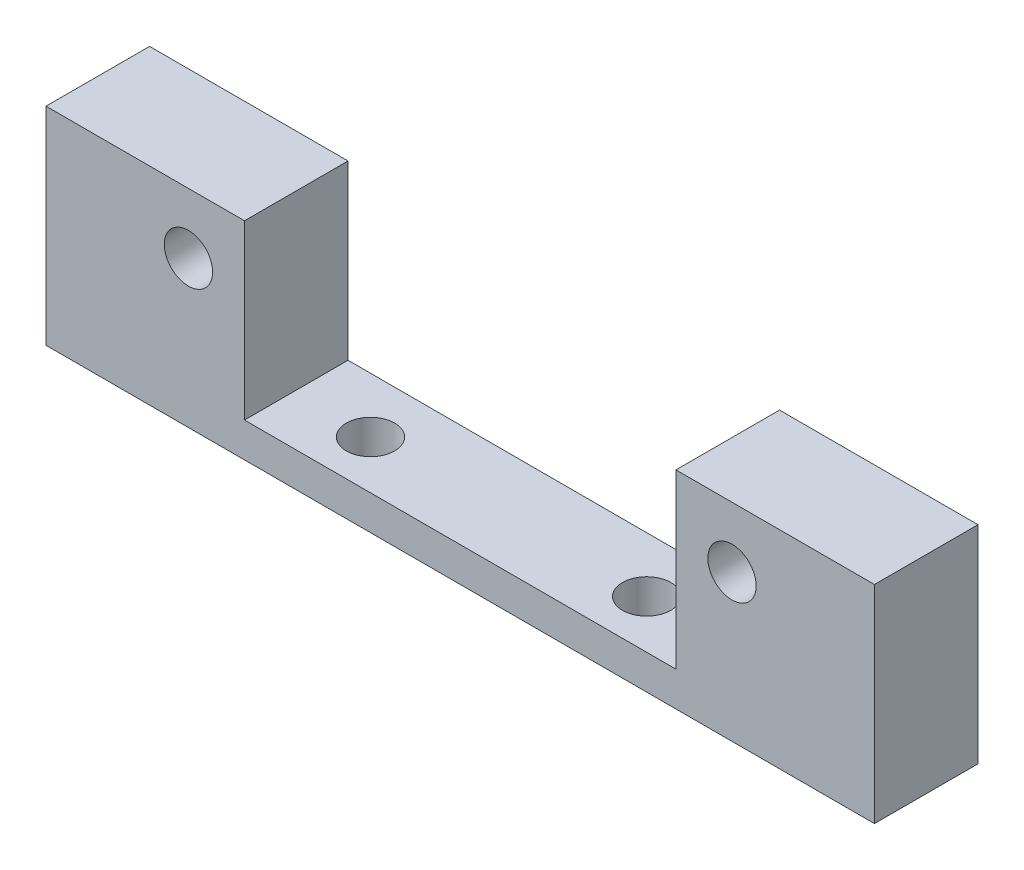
ISO-10303-21;
HEADER;
FILE_DESCRIPTION(('STEP AP214'),'2;1');
FILE_NAME('part.step','',(''),(''),'','','');
FILE_SCHEMA(('AUTOMOTIVE_DESIGN { 1 0 10303 214 1 1 1 1 }'));
ENDSEC;
DATA;
#1=APPLICATION_CONTEXT('core data for automotive mechanical design processes');
#2=APPLICATION_PROTOCOL_DEFINITION('international standard','automotive_design',2000,#1);
#3=PRODUCT_CONTEXT('',#1,'mechanical');
#4=PRODUCT('Part','Part','',(#3));
#5=PRODUCT_RELATED_PRODUCT_CATEGORY('part','',(#4));
#6=PRODUCT_DEFINITION_FORMATION('','',#4);
#7=PRODUCT_DEFINITION_CONTEXT('part definition',#1,'design');
#8=PRODUCT_DEFINITION('design','',#6,#7);
#9=PRODUCT_DEFINITION_SHAPE('','',#8);
#10=(LENGTH_UNIT() NAMED_UNIT(*) SI_UNIT(.MILLI.,.METRE.));
#11=(NAMED_UNIT(*) PLANE_ANGLE_UNIT() SI_UNIT($,.RADIAN.));
#12=(NAMED_UNIT(*) SI_UNIT($,.STERADIAN.) SOLID_ANGLE_UNIT());
#13=UNCERTAINTY_MEASURE_WITH_UNIT(LENGTH_MEASURE(1.E-05),#10,'distance_accuracy_value','');
#14=(GEOMETRIC_REPRESENTATION_CONTEXT(3) GLOBAL_UNCERTAINTY_ASSIGNED_CONTEXT((#13)) GLOBAL_UNIT_ASSIGNED_CONTEXT((#10,
#11,#12)) REPRESENTATION_CONTEXT('',''));
#15=CARTESIAN_POINT('',(0.,0.,0.));
#16=DIRECTION('',(0.,0.,1.));
#17=DIRECTION('',(1.,0.,0.));
#18=AXIS2_PLACEMENT_3D('',#15,#16,#17);
#19=CARTESIAN_POINT('',(0.,0.,0.));
#20=DIRECTION('',(0.,-1.,0.));
#21=DIRECTION('',(0.,0.,-1.));
#22=AXIS2_PLACEMENT_3D('',#19,#20,#21);
#23=PLANE('',#22);
#24=DIRECTION('',(1.,0.,0.));
#25=VECTOR('',#24,1.);
#26=CARTESIAN_POINT('',(-76.2,0.,6.35));
#27=LINE('',#26,#25);
#28=CARTESIAN_POINT('',(-76.2,0.,6.35));
#29=VERTEX_POINT('',#28);
#30=CARTESIAN_POINT('',(-39.6875,0.,6.35));
#31=VERTEX_POINT('',#30);
#32=EDGE_CURVE('E178',#29,#31,#27,.T.);
#33=ORIENTED_EDGE('',*,*,#32,.T.);
#34=DIRECTION('',(0.,0.,1.));
#35=VECTOR('',#34,1.);
#36=CARTESIAN_POINT('',(-39.6875,0.,-12.7));
#37=LINE('',#36,#35);
#38=CARTESIAN_POINT('',(-39.6875,0.,-12.7));
#39=VERTEX_POINT('',#38);
#40=EDGE_CURVE('E138',#39,#31,#37,.T.);
#41=ORIENTED_EDGE('',*,*,#40,.F.);
#42=DIRECTION('',(-1.,0.,0.));
#43=VECTOR('',#42,1.);
#44=CARTESIAN_POINT('',(-76.2,0.,-12.7));
#45=LINE('',#44,#43);
#46=CARTESIAN_POINT('',(-76.2,0.,-12.7));
#47=VERTEX_POINT('',#46);
#48=EDGE_CURVE('E79',#39,#47,#45,.T.);
#49=ORIENTED_EDGE('',*,*,#48,.T.);
#50=DIRECTION('',(0.,0.,1.));
#51=VECTOR('',#50,1.);
#52=CARTESIAN_POINT('',(-76.2,0.,6.35));
#53=LINE('',#52,#51);
#54=EDGE_CURVE('E164',#47,#29,#53,.T.);
#55=ORIENTED_EDGE('',*,*,#54,.T.);
#56=EDGE_LOOP('',(#33,#41,#49,#55));
#57=FACE_BOUND('',#56,.T.);
#58=ADVANCED_FACE('F32',(#57),#23,.F.);
#59=CARTESIAN_POINT('',(-76.2,-38.1,6.35));
#60=DIRECTION('',(-1.,0.,0.));
#61=DIRECTION('',(0.,0.,1.));
#62=AXIS2_PLACEMENT_3D('',#59,#60,#61);
#63=PLANE('',#62);
#64=ORIENTED_EDGE('',*,*,#54,.F.);
#65=DIRECTION('',(0.,1.,0.));
#66=VECTOR('',#65,1.);
#67=CARTESIAN_POINT('',(-76.2,-38.1,-12.7));
#68=LINE('',#67,#66);
#69=CARTESIAN_POINT('',(-76.2,-38.1,-12.7));
#70=VERTEX_POINT('',#69);
#71=EDGE_CURVE('E11',#70,#47,#68,.T.);
#72=ORIENTED_EDGE('',*,*,#71,.F.);
#73=DIRECTION('',(0.,0.,1.));
#74=VECTOR('',#73,1.);
#75=CARTESIAN_POINT('',(-76.2,-38.1,6.35));
#76=LINE('',#75,#74);
#77=CARTESIAN_POINT('',(-76.2,-38.1,6.35));
#78=VERTEX_POINT('',#77);
#79=EDGE_CURVE('E165',#70,#78,#76,.T.);
#80=ORIENTED_EDGE('',*,*,#79,.T.);
#81=DIRECTION('',(0.,1.,0.));
#82=VECTOR('',#81,1.);
#83=CARTESIAN_POINT('',(-76.2,-38.1,6.35));
#84=LINE('',#83,#82);
#85=EDGE_CURVE('E85',#78,#29,#84,.T.);
#86=ORIENTED_EDGE('',*,*,#85,.T.);
#87=EDGE_LOOP('',(#64,#72,#80,#86));
#88=FACE_BOUND('',#87,.T.);
#89=ADVANCED_FACE('F34',(#88),#63,.T.);
#90=CARTESIAN_POINT('',(-76.2,-38.1,-12.7));
#91=DIRECTION('',(0.,0.,-1.));
#92=DIRECTION('',(-1.,0.,0.));
#93=AXIS2_PLACEMENT_3D('',#90,#91,#92);
#94=PLANE('',#93);
#95=DIRECTION('',(0.,-1.,0.));
#96=VECTOR('',#95,1.);
#97=CARTESIAN_POINT('',(-39.6875,0.,-12.7));
#98=LINE('',#97,#96);
#99=CARTESIAN_POINT('',(-39.6875,-31.75,-12.7));
#100=VERTEX_POINT('',#99);
#101=EDGE_CURVE('E112',#39,#100,#98,.T.);
#102=ORIENTED_EDGE('',*,*,#101,.T.);
#103=DIRECTION('',(1.,0.,0.));
#104=VECTOR('',#103,1.);
#105=CARTESIAN_POINT('',(-39.6875,-31.75,-12.7));
#106=LINE('',#105,#104);
#107=CARTESIAN_POINT('',(39.6875,-31.75,-12.7));
#108=VERTEX_POINT('',#107);
#109=EDGE_CURVE('E122',#100,#108,#106,.T.);
#110=ORIENTED_EDGE('',*,*,#109,.T.);
#111=DIRECTION('',(0.,1.,0.));
#112=VECTOR('',#111,1.);
#113=CARTESIAN_POINT('',(39.6875,0.,-12.7));
#114=LINE('',#113,#112);
#115=CARTESIAN_POINT('',(39.6875,0.,-12.7));
#116=VERTEX_POINT('',#115);
#117=EDGE_CURVE('E119',#108,#116,#114,.T.);
#118=ORIENTED_EDGE('',*,*,#117,.T.);
#119=CARTESIAN_POINT('',(76.2,0.,-12.7));
#120=VERTEX_POINT('',#119);
#121=EDGE_CURVE('E168',#120,#116,#45,.T.);
#122=ORIENTED_EDGE('',*,*,#121,.F.);
#123=DIRECTION('',(0.,1.,0.));
#124=VECTOR('',#123,1.);
#125=CARTESIAN_POINT('',(76.2,-38.1,-12.7));
#126=LINE('',#125,#124);
#127=CARTESIAN_POINT('',(76.2,-38.1,-12.7));
#128=VERTEX_POINT('',#127);
#129=EDGE_CURVE('E41',#128,#120,#126,.T.);
#130=ORIENTED_EDGE('',*,*,#129,.F.);
#131=DIRECTION('',(-1.,0.,0.));
#132=VECTOR('',#131,1.);
#133=CARTESIAN_POINT('',(-76.2,-38.1,-12.7));
#134=LINE('',#133,#132);
#135=EDGE_CURVE('E173',#128,#70,#134,.T.);
#136=ORIENTED_EDGE('',*,*,#135,.T.);
#137=ORIENTED_EDGE('',*,*,#71,.T.);
#138=ORIENTED_EDGE('',*,*,#48,.F.);
#139=EDGE_LOOP('',(#102,#110,#118,#122,#130,#136,#137,#138));
#140=FACE_BOUND('',#139,.T.);
#141=CARTESIAN_POINT('',(49.9999,-11.1252,-12.7));
#142=DIRECTION('',(0.,0.,-1.));
#143=DIRECTION('',(-1.,0.,0.));
#144=AXIS2_PLACEMENT_3D('',#141,#142,#143);
#145=CIRCLE('',#144,4.445);
#146=CARTESIAN_POINT('',(54.4449,-11.1252,-12.7));
#147=VERTEX_POINT('',#146);
#148=EDGE_CURVE('E149',#147,#147,#145,.T.);
#149=ORIENTED_EDGE('',*,*,#148,.F.);
#150=EDGE_LOOP('',(#149));
#151=FACE_BOUND('',#150,.T.);
#152=CARTESIAN_POINT('',(-49.9999,-11.1252,-12.7));
#153=DIRECTION('',(0.,0.,-1.));
#154=DIRECTION('',(-1.,0.,0.));
#155=AXIS2_PLACEMENT_3D('',#152,#153,#154);
#156=CIRCLE('',#155,4.445);
#157=CARTESIAN_POINT('',(-45.5549,-11.1252,-12.7));
#158=VERTEX_POINT('',#157);
#159=EDGE_CURVE('E155',#158,#158,#156,.T.);
#160=ORIENTED_EDGE('',*,*,#159,.F.);
#161=EDGE_LOOP('',(#160));
#162=FACE_BOUND('',#161,.T.);
#163=ADVANCED_FACE('F129',(#140,#151,#162),#94,.T.);
#164=CARTESIAN_POINT('',(76.2,-38.1,6.35));
#165=DIRECTION('',(1.,0.,0.));
#166=DIRECTION('',(0.,0.,-1.));
#167=AXIS2_PLACEMENT_3D('',#164,#165,#166);
#168=PLANE('',#167);
#169=DIRECTION('',(0.,0.,-1.));
#170=VECTOR('',#169,1.);
#171=CARTESIAN_POINT('',(76.2,0.,6.35));
#172=LINE('',#171,#170);
#173=CARTESIAN_POINT('',(76.2,0.,6.35));
#174=VERTEX_POINT('',#173);
#175=EDGE_CURVE('E181',#174,#120,#172,.T.);
#176=ORIENTED_EDGE('',*,*,#175,.F.);
#177=DIRECTION('',(0.,1.,0.));
#178=VECTOR('',#177,1.);
#179=CARTESIAN_POINT('',(76.2,-38.1,6.35));
#180=LINE('',#179,#178);
#181=CARTESIAN_POINT('',(76.2,-38.1,6.35));
#182=VERTEX_POINT('',#181);
#183=EDGE_CURVE('E187',#182,#174,#180,.T.);
#184=ORIENTED_EDGE('',*,*,#183,.F.);
#185=DIRECTION('',(0.,0.,-1.));
#186=VECTOR('',#185,1.);
#187=CARTESIAN_POINT('',(76.2,-38.1,6.35));
#188=LINE('',#187,#186);
#189=EDGE_CURVE('E170',#182,#128,#188,.T.);
#190=ORIENTED_EDGE('',*,*,#189,.T.);
#191=ORIENTED_EDGE('',*,*,#129,.T.);
#192=EDGE_LOOP('',(#176,#184,#190,#191));
#193=FACE_BOUND('',#192,.T.);
#194=ADVANCED_FACE('F217',(#193),#168,.T.);
#195=CARTESIAN_POINT('',(-76.2,-38.1,6.35));
#196=DIRECTION('',(0.,0.,1.));
#197=DIRECTION('',(1.,0.,0.));
#198=AXIS2_PLACEMENT_3D('',#195,#196,#197);
#199=PLANE('',#198);
#200=DIRECTION('',(0.,-1.,0.));
#201=VECTOR('',#200,1.);
#202=CARTESIAN_POINT('',(-39.6875,0.,6.35));
#203=LINE('',#202,#201);
#204=CARTESIAN_POINT('',(-39.6875,-31.75,6.35));
#205=VERTEX_POINT('',#204);
#206=EDGE_CURVE('E114',#31,#205,#203,.T.);
#207=ORIENTED_EDGE('',*,*,#206,.F.);
#208=ORIENTED_EDGE('',*,*,#32,.F.);
#209=ORIENTED_EDGE('',*,*,#85,.F.);
#210=DIRECTION('',(1.,0.,0.));
#211=VECTOR('',#210,1.);
#212=CARTESIAN_POINT('',(-76.2,-38.1,6.35));
#213=LINE('',#212,#211);
#214=EDGE_CURVE('E167',#78,#182,#213,.T.);
#215=ORIENTED_EDGE('',*,*,#214,.T.);
#216=ORIENTED_EDGE('',*,*,#183,.T.);
#217=CARTESIAN_POINT('',(39.6875,0.,6.35));
#218=VERTEX_POINT('',#217);
#219=EDGE_CURVE('E177',#218,#174,#27,.T.);
#220=ORIENTED_EDGE('',*,*,#219,.F.);
#221=DIRECTION('',(0.,1.,0.));
#222=VECTOR('',#221,1.);
#223=CARTESIAN_POINT('',(39.6875,0.,6.35));
#224=LINE('',#223,#222);
#225=CARTESIAN_POINT('',(39.6875,-31.75,6.35));
#226=VERTEX_POINT('',#225);
#227=EDGE_CURVE('E49',#226,#218,#224,.T.);
#228=ORIENTED_EDGE('',*,*,#227,.F.);
#229=DIRECTION('',(1.,0.,0.));
#230=VECTOR('',#229,1.);
#231=CARTESIAN_POINT('',(-39.6875,-31.75,6.35));
#232=LINE('',#231,#230);
#233=EDGE_CURVE('E132',#205,#226,#232,.T.);
#234=ORIENTED_EDGE('',*,*,#233,.F.);
#235=EDGE_LOOP('',(#207,#208,#209,#215,#216,#220,#228,#234));
#236=FACE_BOUND('',#235,.T.);
#237=CARTESIAN_POINT('',(49.9999,-11.1252,6.35));
#238=DIRECTION('',(0.,0.,1.));
#239=DIRECTION('',(1.,0.,0.));
#240=AXIS2_PLACEMENT_3D('',#237,#238,#239);
#241=CIRCLE('',#240,4.445);
#242=CARTESIAN_POINT('',(54.4449,-11.1252,6.35));
#243=VERTEX_POINT('',#242);
#244=EDGE_CURVE('E146',#243,#243,#241,.T.);
#245=ORIENTED_EDGE('',*,*,#244,.F.);
#246=EDGE_LOOP('',(#245));
#247=FACE_BOUND('',#246,.T.);
#248=CARTESIAN_POINT('',(-49.9999,-11.1252,6.35));
#249=DIRECTION('',(0.,0.,1.));
#250=DIRECTION('',(1.,0.,0.));
#251=AXIS2_PLACEMENT_3D('',#248,#249,#250);
#252=CIRCLE('',#251,4.445);
#253=CARTESIAN_POINT('',(-45.5549,-11.1252,6.35));
#254=VERTEX_POINT('',#253);
#255=EDGE_CURVE('E152',#254,#254,#252,.T.);
#256=ORIENTED_EDGE('',*,*,#255,.F.);
#257=EDGE_LOOP('',(#256));
#258=FACE_BOUND('',#257,.T.);
#259=ADVANCED_FACE('F189',(#236,#247,#258),#199,.T.);
#260=CARTESIAN_POINT('',(0.,-38.1,0.));
#261=DIRECTION('',(0.,-1.,0.));
#262=DIRECTION('',(0.,0.,-1.));
#263=AXIS2_PLACEMENT_3D('',#260,#261,#262);
#264=PLANE('',#263);
#265=CARTESIAN_POINT('',(25.4,-38.1,-2.54));
#266=DIRECTION('',(0.,1.,0.));
#267=DIRECTION('',(0.,0.,1.));
#268=AXIS2_PLACEMENT_3D('',#265,#266,#267);
#269=CIRCLE('',#268,4.445);
#270=CARTESIAN_POINT('',(25.4,-38.1,1.905));
#271=VERTEX_POINT('',#270);
#272=EDGE_CURVE('E158',#271,#271,#269,.T.);
#273=ORIENTED_EDGE('',*,*,#272,.T.);
#274=EDGE_LOOP('',(#273));
#275=FACE_BOUND('',#274,.T.);
#276=CARTESIAN_POINT('',(-25.4,-38.1,-2.54));
#277=DIRECTION('',(0.,1.,0.));
#278=DIRECTION('',(0.,0.,1.));
#279=AXIS2_PLACEMENT_3D('',#276,#277,#278);
#280=CIRCLE('',#279,4.445);
#281=CARTESIAN_POINT('',(-25.4,-38.1,1.905));
#282=VERTEX_POINT('',#281);
#283=EDGE_CURVE('E161',#282,#282,#280,.T.);
#284=ORIENTED_EDGE('',*,*,#283,.T.);
#285=EDGE_LOOP('',(#284));
#286=FACE_BOUND('',#285,.T.);
#287=ORIENTED_EDGE('',*,*,#79,.F.);
#288=ORIENTED_EDGE('',*,*,#135,.F.);
#289=ORIENTED_EDGE('',*,*,#189,.F.);
#290=ORIENTED_EDGE('',*,*,#214,.F.);
#291=EDGE_LOOP('',(#287,#288,#289,#290));
#292=FACE_BOUND('',#291,.T.);
#293=ADVANCED_FACE('F201',(#275,#286,#292),#264,.T.);
#294=ORIENTED_EDGE('',*,*,#121,.T.);
#295=DIRECTION('',(0.,0.,1.));
#296=VECTOR('',#295,1.);
#297=CARTESIAN_POINT('',(39.6875,0.,-12.7));
#298=LINE('',#297,#296);
#299=EDGE_CURVE('E140',#116,#218,#298,.T.);
#300=ORIENTED_EDGE('',*,*,#299,.T.);
#301=ORIENTED_EDGE('',*,*,#219,.T.);
#302=ORIENTED_EDGE('',*,*,#175,.T.);
#303=EDGE_LOOP('',(#294,#300,#301,#302));
#304=FACE_BOUND('',#303,.T.);
#305=ADVANCED_FACE('F193',(#304),#23,.F.);
#306=CARTESIAN_POINT('',(-25.4,-38.1,-2.54));
#307=DIRECTION('',(0.,1.,0.));
#308=DIRECTION('',(0.,0.,1.));
#309=AXIS2_PLACEMENT_3D('',#306,#307,#308);
#310=CYLINDRICAL_SURFACE('',#309,4.445);
#311=CARTESIAN_POINT('',(-25.4,-31.75,-2.54));
#312=DIRECTION('',(0.,-1.,0.));
#313=DIRECTION('',(0.,0.,-1.));
#314=AXIS2_PLACEMENT_3D('',#311,#312,#313);
#315=CIRCLE('',#314,4.445);
#316=CARTESIAN_POINT('',(-25.4,-31.75,1.905));
#317=VERTEX_POINT('',#316);
#318=EDGE_CURVE('E143',#317,#317,#315,.F.);
#319=CARTESIAN_POINT('',(-25.4,-31.75,1.905));
#320=CARTESIAN_POINT('',(-25.4,-31.8161458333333,1.905));
#321=CARTESIAN_POINT('',(-25.4,-31.8822916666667,1.905));
#322=CARTESIAN_POINT('',(-25.4,-32.0145833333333,1.905));
#323=CARTESIAN_POINT('',(-25.4,-32.0807291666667,1.905));
#324=CARTESIAN_POINT('',(-25.4,-32.2130208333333,1.905));
#325=CARTESIAN_POINT('',(-25.4,-32.2791666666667,1.905));
#326=CARTESIAN_POINT('',(-25.4,-32.4114583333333,1.905));
#327=CARTESIAN_POINT('',(-25.4,-32.4776041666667,1.905));
#328=CARTESIAN_POINT('',(-25.4,-32.6098958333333,1.905));
#329=CARTESIAN_POINT('',(-25.4,-32.6760416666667,1.905));
#330=CARTESIAN_POINT('',(-25.4,-32.8083333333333,1.905));
#331=CARTESIAN_POINT('',(-25.4,-32.8744791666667,1.905));
#332=CARTESIAN_POINT('',(-25.4,-33.0067708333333,1.905));
#333=CARTESIAN_POINT('',(-25.4,-33.0729166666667,1.905));
#334=CARTESIAN_POINT('',(-25.4,-33.2052083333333,1.905));
#335=CARTESIAN_POINT('',(-25.4,-33.2713541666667,1.905));
#336=CARTESIAN_POINT('',(-25.4,-33.4036458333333,1.905));
#337=CARTESIAN_POINT('',(-25.4,-33.4697916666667,1.905));
#338=CARTESIAN_POINT('',(-25.4,-33.6020833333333,1.905));
#339=CARTESIAN_POINT('',(-25.4,-33.6682291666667,1.905));
#340=CARTESIAN_POINT('',(-25.4,-33.8005208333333,1.905));
#341=CARTESIAN_POINT('',(-25.4,-33.8666666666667,1.905));
#342=CARTESIAN_POINT('',(-25.4,-33.9989583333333,1.905));
#343=CARTESIAN_POINT('',(-25.4,-34.0651041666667,1.905));
#344=CARTESIAN_POINT('',(-25.4,-34.1973958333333,1.905));
#345=CARTESIAN_POINT('',(-25.4,-34.2635416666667,1.905));
#346=CARTESIAN_POINT('',(-25.4,-34.3958333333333,1.905));
#347=CARTESIAN_POINT('',(-25.4,-34.4619791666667,1.905));
#348=CARTESIAN_POINT('',(-25.4,-34.5942708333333,1.905));
#349=CARTESIAN_POINT('',(-25.4,-34.6604166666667,1.905));
#350=CARTESIAN_POINT('',(-25.4,-34.7927083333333,1.905));
#351=CARTESIAN_POINT('',(-25.4,-34.8588541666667,1.905));
#352=CARTESIAN_POINT('',(-25.4,-34.9911458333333,1.905));
#353=CARTESIAN_POINT('',(-25.4,-35.0572916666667,1.905));
#354=CARTESIAN_POINT('',(-25.4,-35.1895833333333,1.905));
#355=CARTESIAN_POINT('',(-25.4,-35.2557291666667,1.905));
#356=CARTESIAN_POINT('',(-25.4,-35.3880208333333,1.905));
#357=CARTESIAN_POINT('',(-25.4,-35.4541666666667,1.905));
#358=CARTESIAN_POINT('',(-25.4,-35.5864583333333,1.905));
#359=CARTESIAN_POINT('',(-25.4,-35.6526041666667,1.905));
#360=CARTESIAN_POINT('',(-25.4,-35.7848958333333,1.905));
#361=CARTESIAN_POINT('',(-25.4,-35.8510416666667,1.905));
#362=CARTESIAN_POINT('',(-25.4,-35.9833333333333,1.905));
#363=CARTESIAN_POINT('',(-25.4,-36.0494791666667,1.905));
#364=CARTESIAN_POINT('',(-25.4,-36.1817708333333,1.905));
#365=CARTESIAN_POINT('',(-25.4,-36.2479166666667,1.905));
#366=CARTESIAN_POINT('',(-25.4,-36.3802083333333,1.905));
#367=CARTESIAN_POINT('',(-25.4,-36.4463541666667,1.905));
#368=CARTESIAN_POINT('',(-25.4,-36.5786458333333,1.905));
#369=CARTESIAN_POINT('',(-25.4,-36.6447916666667,1.905));
#370=CARTESIAN_POINT('',(-25.4,-36.7770833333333,1.905));
#371=CARTESIAN_POINT('',(-25.4,-36.8432291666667,1.905));
#372=CARTESIAN_POINT('',(-25.4,-36.9755208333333,1.905));
#373=CARTESIAN_POINT('',(-25.4,-37.0416666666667,1.905));
#374=CARTESIAN_POINT('',(-25.4,-37.1739583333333,1.905));
#375=CARTESIAN_POINT('',(-25.4,-37.2401041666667,1.905));
#376=CARTESIAN_POINT('',(-25.4,-37.3723958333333,1.905));
#377=CARTESIAN_POINT('',(-25.4,-37.4385416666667,1.905));
#378=CARTESIAN_POINT('',(-25.4,-37.5708333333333,1.905));
#379=CARTESIAN_POINT('',(-25.4,-37.6369791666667,1.905));
#380=CARTESIAN_POINT('',(-25.4,-37.7692708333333,1.905));
#381=CARTESIAN_POINT('',(-25.4,-37.8354166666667,1.905));
#382=CARTESIAN_POINT('',(-25.4,-37.9677083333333,1.905));
#383=CARTESIAN_POINT('',(-25.4,-38.0338541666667,1.905));
#384=CARTESIAN_POINT('',(-25.4,-38.1,1.905));
#385=B_SPLINE_CURVE_WITH_KNOTS('',3,(#319,#320,#321,#322,#323,#324,#325,#326,#327,#328,#329,
#330,#331,#332,#333,#334,#335,#336,#337,#338,#339,#340,#341,#342,#343,#344,#345,#346,#347,#348,
#349,#350,#351,#352,#353,#354,#355,#356,#357,#358,#359,#360,#361,#362,#363,#364,#365,#366,#367,
#368,#369,#370,#371,#372,#373,#374,#375,#376,#377,#378,#379,#380,#381,#382,#383,#384),
.UNSPECIFIED.,.F.,.F.,(4,2,2,2,2,2,2,2,2,2,2,2,2,2,2,2,2,2,2,2,2,2,2,2,2,2,2,2,2,2,2,2,4),(0.,
0.198437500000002,0.396875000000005,0.595312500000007,0.793750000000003,0.992187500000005,
1.19062500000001,1.3890625,1.58750000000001,1.78593750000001,1.984375,2.18281250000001,
2.38125000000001,2.5796875,2.77812500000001,2.97656250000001,3.175,3.37343750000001,
3.57187500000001,3.7703125,3.96875000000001,4.16718750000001,4.36562500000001,4.56406250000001,
4.76250000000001,4.96093750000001,5.15937500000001,5.35781250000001,5.55625000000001,
5.75468750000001,5.95312500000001,6.15156250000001,6.35000000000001),.UNSPECIFIED.);
#386=EDGE_CURVE('BSEAM200',#317,#282,#385,.T.);
#387=ORIENTED_EDGE('',*,*,#318,.T.);
#388=ORIENTED_EDGE('',*,*,#283,.F.);
#389=ORIENTED_EDGE('',*,*,#386,.T.);
#390=ORIENTED_EDGE('',*,*,#386,.F.);
#391=EDGE_LOOP('',(#387,#389,#388,#390));
#392=FACE_BOUND('',#391,.T.);
#393=ADVANCED_FACE('F200',(#392),#310,.F.);
#394=CARTESIAN_POINT('',(25.4,-38.1,-2.54));
#395=DIRECTION('',(0.,1.,0.));
#396=DIRECTION('',(0.,0.,1.));
#397=AXIS2_PLACEMENT_3D('',#394,#395,#396);
#398=CYLINDRICAL_SURFACE('',#397,4.445);
#399=CARTESIAN_POINT('',(25.4,-31.75,-2.54));
#400=DIRECTION('',(0.,-1.,0.));
#401=DIRECTION('',(0.,0.,-1.));
#402=AXIS2_PLACEMENT_3D('',#399,#400,#401);
#403=CIRCLE('',#402,4.445);
#404=CARTESIAN_POINT('',(25.4,-31.75,1.905));
#405=VERTEX_POINT('',#404);
#406=EDGE_CURVE('E36',#405,#405,#403,.F.);
#407=CARTESIAN_POINT('',(25.4,-31.75,1.905));
#408=CARTESIAN_POINT('',(25.4,-31.8161458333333,1.905));
#409=CARTESIAN_POINT('',(25.4,-31.8822916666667,1.905));
#410=CARTESIAN_POINT('',(25.4,-32.0145833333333,1.905));
#411=CARTESIAN_POINT('',(25.4,-32.0807291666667,1.905));
#412=CARTESIAN_POINT('',(25.4,-32.2130208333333,1.905));
#413=CARTESIAN_POINT('',(25.4,-32.2791666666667,1.905));
#414=CARTESIAN_POINT('',(25.4,-32.4114583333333,1.905));
#415=CARTESIAN_POINT('',(25.4,-32.4776041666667,1.905));
#416=CARTESIAN_POINT('',(25.4,-32.6098958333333,1.905));
#417=CARTESIAN_POINT('',(25.4,-32.6760416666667,1.905));
#418=CARTESIAN_POINT('',(25.4,-32.8083333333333,1.905));
#419=CARTESIAN_POINT('',(25.4,-32.8744791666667,1.905));
#420=CARTESIAN_POINT('',(25.4,-33.0067708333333,1.905));
#421=CARTESIAN_POINT('',(25.4,-33.0729166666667,1.905));
#422=CARTESIAN_POINT('',(25.4,-33.2052083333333,1.905));
#423=CARTESIAN_POINT('',(25.4,-33.2713541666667,1.905));
#424=CARTESIAN_POINT('',(25.4,-33.4036458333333,1.905));
#425=CARTESIAN_POINT('',(25.4,-33.4697916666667,1.905));
#426=CARTESIAN_POINT('',(25.4,-33.6020833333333,1.905));
#427=CARTESIAN_POINT('',(25.4,-33.6682291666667,1.905));
#428=CARTESIAN_POINT('',(25.4,-33.8005208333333,1.905));
#429=CARTESIAN_POINT('',(25.4,-33.8666666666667,1.905));
#430=CARTESIAN_POINT('',(25.4,-33.9989583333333,1.905));
#431=CARTESIAN_POINT('',(25.4,-34.0651041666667,1.905));
#432=CARTESIAN_POINT('',(25.4,-34.1973958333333,1.905));
#433=CARTESIAN_POINT('',(25.4,-34.2635416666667,1.905));
#434=CARTESIAN_POINT('',(25.4,-34.3958333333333,1.905));
#435=CARTESIAN_POINT('',(25.4,-34.4619791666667,1.905));
#436=CARTESIAN_POINT('',(25.4,-34.5942708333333,1.905));
#437=CARTESIAN_POINT('',(25.4,-34.6604166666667,1.905));
#438=CARTESIAN_POINT('',(25.4,-34.7927083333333,1.905));
#439=CARTESIAN_POINT('',(25.4,-34.8588541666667,1.905));
#440=CARTESIAN_POINT('',(25.4,-34.9911458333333,1.905));
#441=CARTESIAN_POINT('',(25.4,-35.0572916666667,1.905));
#442=CARTESIAN_POINT('',(25.4,-35.1895833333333,1.905));
#443=CARTESIAN_POINT('',(25.4,-35.2557291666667,1.905));
#444=CARTESIAN_POINT('',(25.4,-35.3880208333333,1.905));
#445=CARTESIAN_POINT('',(25.4,-35.4541666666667,1.905));
#446=CARTESIAN_POINT('',(25.4,-35.5864583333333,1.905));
#447=CARTESIAN_POINT('',(25.4,-35.6526041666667,1.905));
#448=CARTESIAN_POINT('',(25.4,-35.7848958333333,1.905));
#449=CARTESIAN_POINT('',(25.4,-35.8510416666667,1.905));
#450=CARTESIAN_POINT('',(25.4,-35.9833333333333,1.905));
#451=CARTESIAN_POINT('',(25.4,-36.0494791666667,1.905));
#452=CARTESIAN_POINT('',(25.4,-36.1817708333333,1.905));
#453=CARTESIAN_POINT('',(25.4,-36.2479166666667,1.905));
#454=CARTESIAN_POINT('',(25.4,-36.3802083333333,1.905));
#455=CARTESIAN_POINT('',(25.4,-36.4463541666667,1.905));
#456=CARTESIAN_POINT('',(25.4,-36.5786458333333,1.905));
#457=CARTESIAN_POINT('',(25.4,-36.6447916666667,1.905));
#458=CARTESIAN_POINT('',(25.4,-36.7770833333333,1.905));
#459=CARTESIAN_POINT('',(25.4,-36.8432291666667,1.905));
#460=CARTESIAN_POINT('',(25.4,-36.9755208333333,1.905));
#461=CARTESIAN_POINT('',(25.4,-37.0416666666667,1.905));
#462=CARTESIAN_POINT('',(25.4,-37.1739583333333,1.905));
#463=CARTESIAN_POINT('',(25.4,-37.2401041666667,1.905));
#464=CARTESIAN_POINT('',(25.4,-37.3723958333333,1.905));
#465=CARTESIAN_POINT('',(25.4,-37.4385416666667,1.905));
#466=CARTESIAN_POINT('',(25.4,-37.5708333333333,1.905));
#467=CARTESIAN_POINT('',(25.4,-37.6369791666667,1.905));
#468=CARTESIAN_POINT('',(25.4,-37.7692708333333,1.905));
#469=CARTESIAN_POINT('',(25.4,-37.8354166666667,1.905));
#470=CARTESIAN_POINT('',(25.4,-37.9677083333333,1.905));
#471=CARTESIAN_POINT('',(25.4,-38.0338541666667,1.905));
#472=CARTESIAN_POINT('',(25.4,-38.1,1.905));
#473=B_SPLINE_CURVE_WITH_KNOTS('',3,(#407,#408,#409,#410,#411,#412,#413,#414,#415,#416,#417,
#418,#419,#420,#421,#422,#423,#424,#425,#426,#427,#428,#429,#430,#431,#432,#433,#434,#435,#436,
#437,#438,#439,#440,#441,#442,#443,#444,#445,#446,#447,#448,#449,#450,#451,#452,#453,#454,#455,
#456,#457,#458,#459,#460,#461,#462,#463,#464,#465,#466,#467,#468,#469,#470,#471,#472),
.UNSPECIFIED.,.F.,.F.,(4,2,2,2,2,2,2,2,2,2,2,2,2,2,2,2,2,2,2,2,2,2,2,2,2,2,2,2,2,2,2,2,4),(0.,
0.198437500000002,0.396875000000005,0.595312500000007,0.793750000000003,0.992187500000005,
1.19062500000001,1.3890625,1.58750000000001,1.78593750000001,1.984375,2.18281250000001,
2.38125000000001,2.5796875,2.77812500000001,2.97656250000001,3.175,3.37343750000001,
3.57187500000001,3.7703125,3.96875000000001,4.16718750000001,4.36562500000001,4.56406250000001,
4.76250000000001,4.96093750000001,5.15937500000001,5.35781250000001,5.55625000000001,
5.75468750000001,5.95312500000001,6.15156250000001,6.35000000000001),.UNSPECIFIED.);
#474=EDGE_CURVE('BSEAM207',#405,#271,#473,.T.);
#475=ORIENTED_EDGE('',*,*,#406,.T.);
#476=ORIENTED_EDGE('',*,*,#272,.F.);
#477=ORIENTED_EDGE('',*,*,#474,.T.);
#478=ORIENTED_EDGE('',*,*,#474,.F.);
#479=EDGE_LOOP('',(#475,#477,#476,#478));
#480=FACE_BOUND('',#479,.T.);
#481=ADVANCED_FACE('F207',(#480),#398,.F.);
#482=CARTESIAN_POINT('',(-49.9999,-11.1252,-31.75));
#483=DIRECTION('',(0.,0.,1.));
#484=DIRECTION('',(1.,0.,0.));
#485=AXIS2_PLACEMENT_3D('',#482,#483,#484);
#486=CYLINDRICAL_SURFACE('',#485,4.445);
#487=CARTESIAN_POINT('',(-45.5549,-11.1252,-12.7));
#488=CARTESIAN_POINT('',(-45.5549,-11.1252,-12.5015625));
#489=CARTESIAN_POINT('',(-45.5549,-11.1252,-12.303125));
#490=CARTESIAN_POINT('',(-45.5549,-11.1252,-11.90625));
#491=CARTESIAN_POINT('',(-45.5549,-11.1252,-11.7078125));
#492=CARTESIAN_POINT('',(-45.5549,-11.1252,-11.3109375));
#493=CARTESIAN_POINT('',(-45.5549,-11.1252,-11.1125));
#494=CARTESIAN_POINT('',(-45.5549,-11.1252,-10.715625));
#495=CARTESIAN_POINT('',(-45.5549,-11.1252,-10.5171875));
#496=CARTESIAN_POINT('',(-45.5549,-11.1252,-10.1203125));
#497=CARTESIAN_POINT('',(-45.5549,-11.1252,-9.921875));
#498=CARTESIAN_POINT('',(-45.5549,-11.1252,-9.525));
#499=CARTESIAN_POINT('',(-45.5549,-11.1252,-9.3265625));
#500=CARTESIAN_POINT('',(-45.5549,-11.1252,-8.9296875));
#501=CARTESIAN_POINT('',(-45.5549,-11.1252,-8.73125));
#502=CARTESIAN_POINT('',(-45.5549,-11.1252,-8.334375));
#503=CARTESIAN_POINT('',(-45.5549,-11.1252,-8.1359375));
#504=CARTESIAN_POINT('',(-45.5549,-11.1252,-7.7390625));
#505=CARTESIAN_POINT('',(-45.5549,-11.1252,-7.540625));
#506=CARTESIAN_POINT('',(-45.5549,-11.1252,-7.14375));
#507=CARTESIAN_POINT('',(-45.5549,-11.1252,-6.9453125));
#508=CARTESIAN_POINT('',(-45.5549,-11.1252,-6.5484375));
#509=CARTESIAN_POINT('',(-45.5549,-11.1252,-6.35));
#510=CARTESIAN_POINT('',(-45.5549,-11.1252,-5.953125));
#511=CARTESIAN_POINT('',(-45.5549,-11.1252,-5.7546875));
#512=CARTESIAN_POINT('',(-45.5549,-11.1252,-5.3578125));
#513=CARTESIAN_POINT('',(-45.5549,-11.1252,-5.159375));
#514=CARTESIAN_POINT('',(-45.5549,-11.1252,-4.7625));
#515=CARTESIAN_POINT('',(-45.5549,-11.1252,-4.5640625));
#516=CARTESIAN_POINT('',(-45.5549,-11.1252,-4.1671875));
#517=CARTESIAN_POINT('',(-45.5549,-11.1252,-3.96875));
#518=CARTESIAN_POINT('',(-45.5549,-11.1252,-3.571875));
#519=CARTESIAN_POINT('',(-45.5549,-11.1252,-3.3734375));
#520=CARTESIAN_POINT('',(-45.5549,-11.1252,-2.9765625));
#521=CARTESIAN_POINT('',(-45.5549,-11.1252,-2.778125));
#522=CARTESIAN_POINT('',(-45.5549,-11.1252,-2.38125));
#523=CARTESIAN_POINT('',(-45.5549,-11.1252,-2.1828125));
#524=CARTESIAN_POINT('',(-45.5549,-11.1252,-1.7859375));
#525=CARTESIAN_POINT('',(-45.5549,-11.1252,-1.5875));
#526=CARTESIAN_POINT('',(-45.5549,-11.1252,-1.190625));
#527=CARTESIAN_POINT('',(-45.5549,-11.1252,-0.992187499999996));
#528=CARTESIAN_POINT('',(-45.5549,-11.1252,-0.595312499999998));
#529=CARTESIAN_POINT('',(-45.5549,-11.1252,-0.396875));
#530=CARTESIAN_POINT('',(-45.5549,-11.1252,0.));
#531=CARTESIAN_POINT('',(-45.5549,-11.1252,0.198437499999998));
#532=CARTESIAN_POINT('',(-45.5549,-11.1252,0.595312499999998));
#533=CARTESIAN_POINT('',(-45.5549,-11.1252,0.793749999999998));
#534=CARTESIAN_POINT('',(-45.5549,-11.1252,1.190625));
#535=CARTESIAN_POINT('',(-45.5549,-11.1252,1.3890625));
#536=CARTESIAN_POINT('',(-45.5549,-11.1252,1.7859375));
#537=CARTESIAN_POINT('',(-45.5549,-11.1252,1.984375));
#538=CARTESIAN_POINT('',(-45.5549,-11.1252,2.38125));
#539=CARTESIAN_POINT('',(-45.5549,-11.1252,2.5796875));
#540=CARTESIAN_POINT('',(-45.5549,-11.1252,2.9765625));
#541=CARTESIAN_POINT('',(-45.5549,-11.1252,3.175));
#542=CARTESIAN_POINT('',(-45.5549,-11.1252,3.571875));
#543=CARTESIAN_POINT('',(-45.5549,-11.1252,3.7703125));
#544=CARTESIAN_POINT('',(-45.5549,-11.1252,4.1671875));
#545=CARTESIAN_POINT('',(-45.5549,-11.1252,4.365625));
#546=CARTESIAN_POINT('',(-45.5549,-11.1252,4.7625));
#547=CARTESIAN_POINT('',(-45.5549,-11.1252,4.9609375));
#548=CARTESIAN_POINT('',(-45.5549,-11.1252,5.3578125));
#549=CARTESIAN_POINT('',(-45.5549,-11.1252,5.55625));
#550=CARTESIAN_POINT('',(-45.5549,-11.1252,5.953125));
#551=CARTESIAN_POINT('',(-45.5549,-11.1252,6.1515625));
#552=CARTESIAN_POINT('',(-45.5549,-11.1252,6.35));
#553=B_SPLINE_CURVE_WITH_KNOTS('',3,(#487,#488,#489,#490,#491,#492,#493,#494,#495,#496,#497,
#498,#499,#500,#501,#502,#503,#504,#505,#506,#507,#508,#509,#510,#511,#512,#513,#514,#515,#516,
#517,#518,#519,#520,#521,#522,#523,#524,#525,#526,#527,#528,#529,#530,#531,#532,#533,#534,#535,
#536,#537,#538,#539,#540,#541,#542,#543,#544,#545,#546,#547,#548,#549,#550,#551,#552),
.UNSPECIFIED.,.F.,.F.,(4,2,2,2,2,2,2,2,2,2,2,2,2,2,2,2,2,2,2,2,2,2,2,2,2,2,2,2,2,2,2,2,4),(0.,
0.5953125,1.190625,1.7859375,2.38125,2.9765625,3.571875,4.1671875,4.7625,5.3578125,5.953125,
6.5484375,7.14375,7.7390625,8.334375,8.9296875,9.525,10.1203125,10.715625,11.3109375,11.90625,
12.5015625,13.096875,13.6921875,14.2875,14.8828125,15.478125,16.0734375,16.66875,17.2640625,
17.859375,18.4546875,19.05),.UNSPECIFIED.);
#554=EDGE_CURVE('BSEAM250',#158,#254,#553,.T.);
#555=ORIENTED_EDGE('',*,*,#159,.T.);
#556=ORIENTED_EDGE('',*,*,#255,.T.);
#557=ORIENTED_EDGE('',*,*,#554,.T.);
#558=ORIENTED_EDGE('',*,*,#554,.F.);
#559=EDGE_LOOP('',(#555,#557,#556,#558));
#560=FACE_BOUND('',#559,.T.);
#561=ADVANCED_FACE('F250',(#560),#486,.F.);
#562=CARTESIAN_POINT('',(49.9999,-11.1252,-31.75));
#563=DIRECTION('',(0.,0.,1.));
#564=DIRECTION('',(1.,0.,0.));
#565=AXIS2_PLACEMENT_3D('',#562,#563,#564);
#566=CYLINDRICAL_SURFACE('',#565,4.445);
#567=CARTESIAN_POINT('',(54.4449,-11.1252,-12.7));
#568=CARTESIAN_POINT('',(54.4449,-11.1252,-12.5015625));
#569=CARTESIAN_POINT('',(54.4449,-11.1252,-12.303125));
#570=CARTESIAN_POINT('',(54.4449,-11.1252,-11.90625));
#571=CARTESIAN_POINT('',(54.4449,-11.1252,-11.7078125));
#572=CARTESIAN_POINT('',(54.4449,-11.1252,-11.3109375));
#573=CARTESIAN_POINT('',(54.4449,-11.1252,-11.1125));
#574=CARTESIAN_POINT('',(54.4449,-11.1252,-10.715625));
#575=CARTESIAN_POINT('',(54.4449,-11.1252,-10.5171875));
#576=CARTESIAN_POINT('',(54.4449,-11.1252,-10.1203125));
#577=CARTESIAN_POINT('',(54.4449,-11.1252,-9.921875));
#578=CARTESIAN_POINT('',(54.4449,-11.1252,-9.525));
#579=CARTESIAN_POINT('',(54.4449,-11.1252,-9.3265625));
#580=CARTESIAN_POINT('',(54.4449,-11.1252,-8.9296875));
#581=CARTESIAN_POINT('',(54.4449,-11.1252,-8.73125));
#582=CARTESIAN_POINT('',(54.4449,-11.1252,-8.334375));
#583=CARTESIAN_POINT('',(54.4449,-11.1252,-8.1359375));
#584=CARTESIAN_POINT('',(54.4449,-11.1252,-7.7390625));
#585=CARTESIAN_POINT('',(54.4449,-11.1252,-7.540625));
#586=CARTESIAN_POINT('',(54.4449,-11.1252,-7.14375));
#587=CARTESIAN_POINT('',(54.4449,-11.1252,-6.9453125));
#588=CARTESIAN_POINT('',(54.4449,-11.1252,-6.5484375));
#589=CARTESIAN_POINT('',(54.4449,-11.1252,-6.35));
#590=CARTESIAN_POINT('',(54.4449,-11.1252,-5.953125));
#591=CARTESIAN_POINT('',(54.4449,-11.1252,-5.7546875));
#592=CARTESIAN_POINT('',(54.4449,-11.1252,-5.3578125));
#593=CARTESIAN_POINT('',(54.4449,-11.1252,-5.159375));
#594=CARTESIAN_POINT('',(54.4449,-11.1252,-4.7625));
#595=CARTESIAN_POINT('',(54.4449,-11.1252,-4.5640625));
#596=CARTESIAN_POINT('',(54.4449,-11.1252,-4.1671875));
#597=CARTESIAN_POINT('',(54.4449,-11.1252,-3.96875));
#598=CARTESIAN_POINT('',(54.4449,-11.1252,-3.571875));
#599=CARTESIAN_POINT('',(54.4449,-11.1252,-3.3734375));
#600=CARTESIAN_POINT('',(54.4449,-11.1252,-2.9765625));
#601=CARTESIAN_POINT('',(54.4449,-11.1252,-2.778125));
#602=CARTESIAN_POINT('',(54.4449,-11.1252,-2.38125));
#603=CARTESIAN_POINT('',(54.4449,-11.1252,-2.1828125));
#604=CARTESIAN_POINT('',(54.4449,-11.1252,-1.7859375));
#605=CARTESIAN_POINT('',(54.4449,-11.1252,-1.5875));
#606=CARTESIAN_POINT('',(54.4449,-11.1252,-1.190625));
#607=CARTESIAN_POINT('',(54.4449,-11.1252,-0.992187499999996));
#608=CARTESIAN_POINT('',(54.4449,-11.1252,-0.595312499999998));
#609=CARTESIAN_POINT('',(54.4449,-11.1252,-0.396875));
#610=CARTESIAN_POINT('',(54.4449,-11.1252,0.));
#611=CARTESIAN_POINT('',(54.4449,-11.1252,0.198437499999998));
#612=CARTESIAN_POINT('',(54.4449,-11.1252,0.595312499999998));
#613=CARTESIAN_POINT('',(54.4449,-11.1252,0.793749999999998));
#614=CARTESIAN_POINT('',(54.4449,-11.1252,1.190625));
#615=CARTESIAN_POINT('',(54.4449,-11.1252,1.3890625));
#616=CARTESIAN_POINT('',(54.4449,-11.1252,1.7859375));
#617=CARTESIAN_POINT('',(54.4449,-11.1252,1.984375));
#618=CARTESIAN_POINT('',(54.4449,-11.1252,2.38125));
#619=CARTESIAN_POINT('',(54.4449,-11.1252,2.5796875));
#620=CARTESIAN_POINT('',(54.4449,-11.1252,2.9765625));
#621=CARTESIAN_POINT('',(54.4449,-11.1252,3.175));
#622=CARTESIAN_POINT('',(54.4449,-11.1252,3.571875));
#623=CARTESIAN_POINT('',(54.4449,-11.1252,3.7703125));
#624=CARTESIAN_POINT('',(54.4449,-11.1252,4.1671875));
#625=CARTESIAN_POINT('',(54.4449,-11.1252,4.365625));
#626=CARTESIAN_POINT('',(54.4449,-11.1252,4.7625));
#627=CARTESIAN_POINT('',(54.4449,-11.1252,4.9609375));
#628=CARTESIAN_POINT('',(54.4449,-11.1252,5.3578125));
#629=CARTESIAN_POINT('',(54.4449,-11.1252,5.55625));
#630=CARTESIAN_POINT('',(54.4449,-11.1252,5.953125));
#631=CARTESIAN_POINT('',(54.4449,-11.1252,6.1515625));
#632=CARTESIAN_POINT('',(54.4449,-11.1252,6.35));
#633=B_SPLINE_CURVE_WITH_KNOTS('',3,(#567,#568,#569,#570,#571,#572,#573,#574,#575,#576,#577,
#578,#579,#580,#581,#582,#583,#584,#585,#586,#587,#588,#589,#590,#591,#592,#593,#594,#595,#596,
#597,#598,#599,#600,#601,#602,#603,#604,#605,#606,#607,#608,#609,#610,#611,#612,#613,#614,#615,
#616,#617,#618,#619,#620,#621,#622,#623,#624,#625,#626,#627,#628,#629,#630,#631,#632),
.UNSPECIFIED.,.F.,.F.,(4,2,2,2,2,2,2,2,2,2,2,2,2,2,2,2,2,2,2,2,2,2,2,2,2,2,2,2,2,2,2,2,4),(0.,
0.5953125,1.190625,1.7859375,2.38125,2.9765625,3.571875,4.1671875,4.7625,5.3578125,5.953125,
6.5484375,7.14375,7.7390625,8.334375,8.9296875,9.525,10.1203125,10.715625,11.3109375,11.90625,
12.5015625,13.096875,13.6921875,14.2875,14.8828125,15.478125,16.0734375,16.66875,17.2640625,
17.859375,18.4546875,19.05),.UNSPECIFIED.);
#634=EDGE_CURVE('BSEAM255',#147,#243,#633,.T.);
#635=ORIENTED_EDGE('',*,*,#148,.T.);
#636=ORIENTED_EDGE('',*,*,#244,.T.);
#637=ORIENTED_EDGE('',*,*,#634,.T.);
#638=ORIENTED_EDGE('',*,*,#634,.F.);
#639=EDGE_LOOP('',(#635,#637,#636,#638));
#640=FACE_BOUND('',#639,.T.);
#641=ADVANCED_FACE('F255',(#640),#566,.F.);
#642=CARTESIAN_POINT('',(-39.6875,-31.75,-12.7));
#643=DIRECTION('',(0.,-1.,0.));
#644=DIRECTION('',(0.,0.,-1.));
#645=AXIS2_PLACEMENT_3D('',#642,#643,#644);
#646=PLANE('',#645);
#647=ORIENTED_EDGE('',*,*,#406,.F.);
#648=EDGE_LOOP('',(#647));
#649=FACE_BOUND('',#648,.T.);
#650=ORIENTED_EDGE('',*,*,#233,.T.);
#651=DIRECTION('',(0.,0.,1.));
#652=VECTOR('',#651,1.);
#653=CARTESIAN_POINT('',(39.6875,-31.75,-12.7));
#654=LINE('',#653,#652);
#655=EDGE_CURVE('E118',#108,#226,#654,.T.);
#656=ORIENTED_EDGE('',*,*,#655,.F.);
#657=ORIENTED_EDGE('',*,*,#109,.F.);
#658=DIRECTION('',(0.,0.,1.));
#659=VECTOR('',#658,1.);
#660=CARTESIAN_POINT('',(-39.6875,-31.75,-12.7));
#661=LINE('',#660,#659);
#662=EDGE_CURVE('E108',#100,#205,#661,.T.);
#663=ORIENTED_EDGE('',*,*,#662,.T.);
#664=EDGE_LOOP('',(#650,#656,#657,#663));
#665=FACE_BOUND('',#664,.T.);
#666=ORIENTED_EDGE('',*,*,#318,.F.);
#667=EDGE_LOOP('',(#666));
#668=FACE_BOUND('',#667,.T.);
#669=ADVANCED_FACE('F123',(#649,#665,#668),#646,.F.);
#670=CARTESIAN_POINT('',(-39.6875,0.,-12.7));
#671=DIRECTION('',(-1.,0.,0.));
#672=DIRECTION('',(0.,-1.,0.));
#673=AXIS2_PLACEMENT_3D('',#670,#671,#672);
#674=PLANE('',#673);
#675=ORIENTED_EDGE('',*,*,#206,.T.);
#676=ORIENTED_EDGE('',*,*,#662,.F.);
#677=ORIENTED_EDGE('',*,*,#101,.F.);
#678=ORIENTED_EDGE('',*,*,#40,.T.);
#679=EDGE_LOOP('',(#675,#676,#677,#678));
#680=FACE_BOUND('',#679,.T.);
#681=ADVANCED_FACE('F110',(#680),#674,.F.);
#682=CARTESIAN_POINT('',(39.6875,0.,-12.7));
#683=DIRECTION('',(1.,0.,0.));
#684=DIRECTION('',(0.,1.,0.));
#685=AXIS2_PLACEMENT_3D('',#682,#683,#684);
#686=PLANE('',#685);
#687=ORIENTED_EDGE('',*,*,#227,.T.);
#688=ORIENTED_EDGE('',*,*,#299,.F.);
#689=ORIENTED_EDGE('',*,*,#117,.F.);
#690=ORIENTED_EDGE('',*,*,#655,.T.);
#691=EDGE_LOOP('',(#687,#688,#689,#690));
#692=FACE_BOUND('',#691,.T.);
#693=ADVANCED_FACE('F214',(#692),#686,.F.);
#694=CLOSED_SHELL('',(#58,#89,#163,#194,#259,#293,#305,#393,#481,#561,#641,#669,#681,#693));
#695=MANIFOLD_SOLID_BREP('B2',#694);
#696=ADVANCED_BREP_SHAPE_REPRESENTATION('',(#18,#695),#14);
#697=SHAPE_DEFINITION_REPRESENTATION(#9,#696);
ENDSEC;
END-ISO-10303-21;
